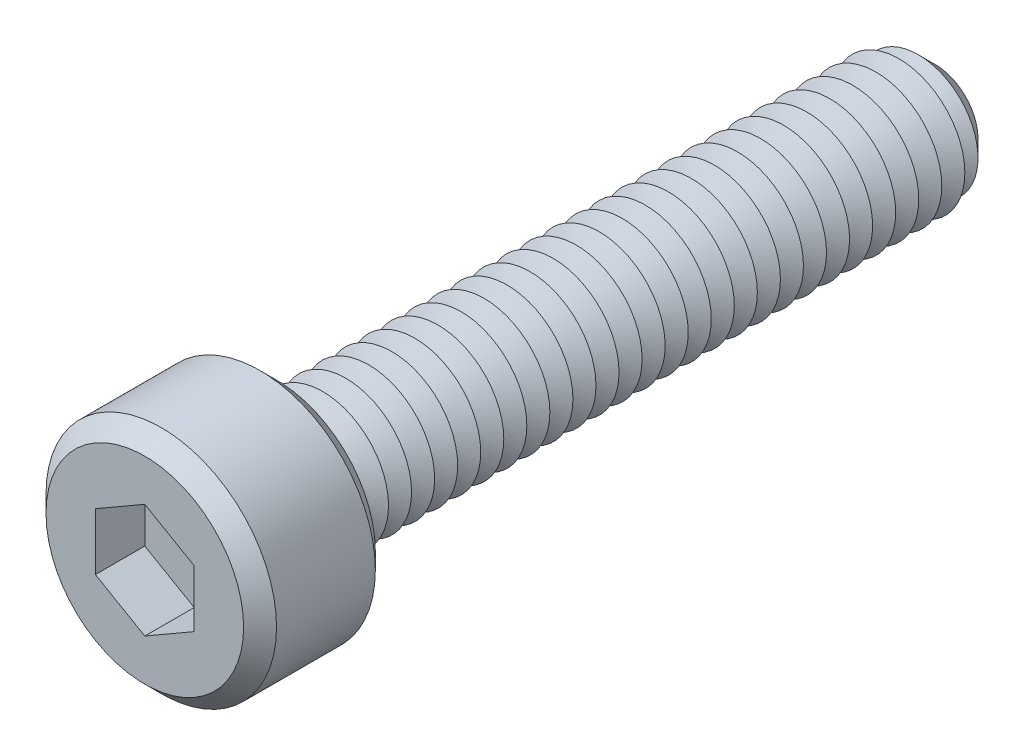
from build123d import *

# Parameters (mm, degrees)
SKETCH1_R           = 3.5
BOSS_EXTRUDE1_DEPTH = 4
SKETCH2_R           = 2
BOSS_EXTRUDE2_DEPTH = 20
CHAMFER1_SIZE       = 0.7
LPATTERN1_COUNT     = 28
LPATTERN1_PITCH     = 0.7
CUT_EXTRUDE1_DEPTH  = 1.5
SKETCH6_R           = 0.5
CUT_EXTRUDE2_DEPTH  = 22.5
CHAMFER2_SIZE       = 0.5


with BuildPart() as part:
    # Sketch1 → Boss-Extrude1 (new body)
    with BuildSketch(Plane.XY):
        Circle(SKETCH1_R)
    extrude(amount=BOSS_EXTRUDE1_DEPTH)

    # Sketch2 → Boss-Extrude2 (add)
    with BuildSketch(Plane(origin=(0, 0, 0), x_dir=(-1, 0, 0), z_dir=(0, 0, -1))):
        Circle(SKETCH2_R)
    extrude(amount=BOSS_EXTRUDE2_DEPTH)

    # Chamfer1
    chamfer1_edges = [part.edges().sort_by_distance(p)[0] for p in [
        (2, 0, -20),
    ]]
    chamfer(chamfer1_edges, length=CHAMFER1_SIZE)

    # Sketch4 → Cut-Revolve1 (revolve, cut)
    with BuildSketch(Plane(origin=(0, 0, 0), x_dir=(0, 0, -1), z_dir=(1, 0, 0)), mode=Mode.PRIVATE) as cut_revolve1_sk:
        Polygon((0, 2), (0.35, 1.393782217), (0.7, 2), align=None)
    cut_revolve1 = revolve(cut_revolve1_sk.sketch.rotate(Axis((0, 0, 2.512122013), (0, 0, -1)), 90), axis=Axis((0, 0, 2.512122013), (0, 0, -1)), mode=Mode.SUBTRACT)

    # LPattern1: Cut-Revolve1 ×28
    with Locations(*[(0, 0, -i * LPATTERN1_PITCH) for i in range(1, LPATTERN1_COUNT)]):
        add(cut_revolve1, mode=Mode.SUBTRACT)

    # Sketch5 → Cut-Extrude1 (cut)
    with BuildSketch(Plane.XY.offset(4)):
        Polygon((0, 1.732050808), (-1.5, 0.866025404), (-1.5, -0.866025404), (0, -1.732050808), (1.5, -0.866025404), (1.5, 0.866025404), align=None)
    extrude(amount=-CUT_EXTRUDE1_DEPTH, mode=Mode.SUBTRACT)

    # Sketch6 → Cut-Extrude2 (cut)
    with BuildSketch(Plane.XY.offset(2.5)):
        Circle(SKETCH6_R)
    extrude(amount=-CUT_EXTRUDE2_DEPTH, mode=Mode.SUBTRACT)

    # Chamfer2
    chamfer2_edges = [part.edges().sort_by_distance(p)[0] for p in [
        (-3.5, 0, 0),
        (-3.5, 0, 4),
    ]]
    chamfer(chamfer2_edges, length=CHAMFER2_SIZE)


solid = part.part
